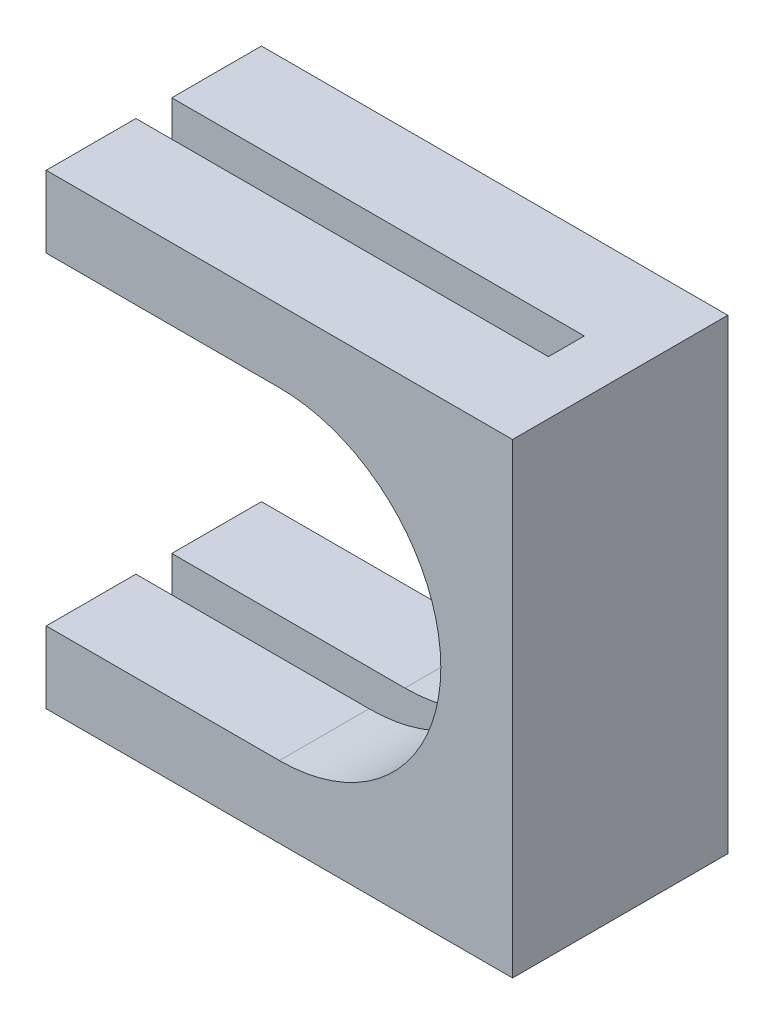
ISO-10303-21;
HEADER;
FILE_DESCRIPTION(('STEP AP214'),'2;1');
FILE_NAME('part.step','',(''),(''),'','','');
FILE_SCHEMA(('AUTOMOTIVE_DESIGN { 1 0 10303 214 1 1 1 1 }'));
ENDSEC;
DATA;
#1=APPLICATION_CONTEXT('core data for automotive mechanical design processes');
#2=APPLICATION_PROTOCOL_DEFINITION('international standard','automotive_design',2000,#1);
#3=PRODUCT_CONTEXT('',#1,'mechanical');
#4=PRODUCT('Part','Part','',(#3));
#5=PRODUCT_RELATED_PRODUCT_CATEGORY('part','',(#4));
#6=PRODUCT_DEFINITION_FORMATION('','',#4);
#7=PRODUCT_DEFINITION_CONTEXT('part definition',#1,'design');
#8=PRODUCT_DEFINITION('design','',#6,#7);
#9=PRODUCT_DEFINITION_SHAPE('','',#8);
#10=(LENGTH_UNIT() NAMED_UNIT(*) SI_UNIT(.MILLI.,.METRE.));
#11=(NAMED_UNIT(*) PLANE_ANGLE_UNIT() SI_UNIT($,.RADIAN.));
#12=(NAMED_UNIT(*) SI_UNIT($,.STERADIAN.) SOLID_ANGLE_UNIT());
#13=UNCERTAINTY_MEASURE_WITH_UNIT(LENGTH_MEASURE(1.E-05),#10,'distance_accuracy_value','');
#14=(GEOMETRIC_REPRESENTATION_CONTEXT(3) GLOBAL_UNCERTAINTY_ASSIGNED_CONTEXT((#13)) GLOBAL_UNIT_ASSIGNED_CONTEXT((#10,
#11,#12)) REPRESENTATION_CONTEXT('',''));
#15=CARTESIAN_POINT('',(0.,0.,0.));
#16=DIRECTION('',(0.,0.,1.));
#17=DIRECTION('',(1.,0.,0.));
#18=AXIS2_PLACEMENT_3D('',#15,#16,#17);
#19=CARTESIAN_POINT('',(3.,0.,0.));
#20=DIRECTION('',(-1.,0.,0.));
#21=DIRECTION('',(0.,0.,1.));
#22=AXIS2_PLACEMENT_3D('',#19,#20,#21);
#23=PLANE('',#22);
#24=DIRECTION('',(0.,1.,0.));
#25=VECTOR('',#24,1.);
#26=CARTESIAN_POINT('',(3.,0.,-28.));
#27=LINE('',#26,#25);
#28=CARTESIAN_POINT('',(3.,-3.,-28.));
#29=VERTEX_POINT('',#28);
#30=CARTESIAN_POINT('',(3.,23.,-28.));
#31=VERTEX_POINT('',#30);
#32=EDGE_CURVE('E189',#29,#31,#27,.T.);
#33=ORIENTED_EDGE('',*,*,#32,.F.);
#34=DIRECTION('',(0.,0.,1.));
#35=VECTOR('',#34,1.);
#36=CARTESIAN_POINT('',(3.,-3.,-40.));
#37=LINE('',#36,#35);
#38=CARTESIAN_POINT('',(3.,-3.,-40.));
#39=VERTEX_POINT('',#38);
#40=EDGE_CURVE('E238',#39,#29,#37,.T.);
#41=ORIENTED_EDGE('',*,*,#40,.F.);
#42=DIRECTION('',(0.,-1.,0.));
#43=VECTOR('',#42,1.);
#44=CARTESIAN_POINT('',(3.,20.,-40.));
#45=LINE('',#44,#43);
#46=CARTESIAN_POINT('',(3.,23.,-40.));
#47=VERTEX_POINT('',#46);
#48=EDGE_CURVE('E248',#47,#39,#45,.T.);
#49=ORIENTED_EDGE('',*,*,#48,.F.);
#50=DIRECTION('',(0.,0.,1.));
#51=VECTOR('',#50,1.);
#52=CARTESIAN_POINT('',(3.,23.,-55.0227155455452));
#53=LINE('',#52,#51);
#54=EDGE_CURVE('E196',#47,#31,#53,.T.);
#55=ORIENTED_EDGE('',*,*,#54,.T.);
#56=EDGE_LOOP('',(#33,#41,#49,#55));
#57=FACE_BOUND('',#56,.T.);
#58=ADVANCED_FACE('F49',(#57),#23,.F.);
#59=CARTESIAN_POINT('',(0.,-3.,0.));
#60=DIRECTION('',(0.,-1.,0.));
#61=DIRECTION('',(0.,0.,-1.));
#62=AXIS2_PLACEMENT_3D('',#59,#60,#61);
#63=PLANE('',#62);
#64=ORIENTED_EDGE('',*,*,#40,.T.);
#65=DIRECTION('',(-1.,0.,0.));
#66=VECTOR('',#65,1.);
#67=CARTESIAN_POINT('',(0.,-3.,-28.));
#68=LINE('',#67,#66);
#69=CARTESIAN_POINT('',(-23.,-3.,-28.));
#70=VERTEX_POINT('',#69);
#71=EDGE_CURVE('E67',#29,#70,#68,.T.);
#72=ORIENTED_EDGE('',*,*,#71,.T.);
#73=DIRECTION('',(0.,0.,-1.));
#74=VECTOR('',#73,1.);
#75=CARTESIAN_POINT('',(-23.,-3.,-28.));
#76=LINE('',#75,#74);
#77=CARTESIAN_POINT('',(-23.,-3.,-33.));
#78=VERTEX_POINT('',#77);
#79=EDGE_CURVE('E214',#70,#78,#76,.T.);
#80=ORIENTED_EDGE('',*,*,#79,.T.);
#81=DIRECTION('',(1.,0.,0.));
#82=VECTOR('',#81,1.);
#83=CARTESIAN_POINT('',(-23.,-3.,-33.));
#84=LINE('',#83,#82);
#85=CARTESIAN_POINT('',(0.,-3.,-33.));
#86=VERTEX_POINT('',#85);
#87=EDGE_CURVE('E218',#78,#86,#84,.T.);
#88=ORIENTED_EDGE('',*,*,#87,.T.);
#89=DIRECTION('',(0.,0.,-1.));
#90=VECTOR('',#89,1.);
#91=CARTESIAN_POINT('',(0.,-3.,-33.));
#92=LINE('',#91,#90);
#93=CARTESIAN_POINT('',(0.,-3.,-35.));
#94=VERTEX_POINT('',#93);
#95=EDGE_CURVE('E222',#86,#94,#92,.T.);
#96=ORIENTED_EDGE('',*,*,#95,.T.);
#97=DIRECTION('',(-1.,0.,0.));
#98=VECTOR('',#97,1.);
#99=CARTESIAN_POINT('',(0.,-3.,-35.));
#100=LINE('',#99,#98);
#101=CARTESIAN_POINT('',(-23.,-3.,-35.));
#102=VERTEX_POINT('',#101);
#103=EDGE_CURVE('E226',#94,#102,#100,.T.);
#104=ORIENTED_EDGE('',*,*,#103,.T.);
#105=DIRECTION('',(0.,0.,-1.));
#106=VECTOR('',#105,1.);
#107=CARTESIAN_POINT('',(-23.,-3.,-35.));
#108=LINE('',#107,#106);
#109=CARTESIAN_POINT('',(-23.,-3.,-40.));
#110=VERTEX_POINT('',#109);
#111=EDGE_CURVE('E230',#102,#110,#108,.T.);
#112=ORIENTED_EDGE('',*,*,#111,.T.);
#113=DIRECTION('',(1.,0.,0.));
#114=VECTOR('',#113,1.);
#115=CARTESIAN_POINT('',(-23.,-3.,-40.));
#116=LINE('',#115,#114);
#117=EDGE_CURVE('E234',#110,#39,#116,.T.);
#118=ORIENTED_EDGE('',*,*,#117,.T.);
#119=EDGE_LOOP('',(#64,#72,#80,#88,#96,#104,#112,#118));
#120=FACE_BOUND('',#119,.T.);
#121=ADVANCED_FACE('F352',(#120),#63,.T.);
#122=CARTESIAN_POINT('',(0.,23.,0.));
#123=DIRECTION('',(0.,-1.,0.));
#124=DIRECTION('',(0.,0.,-1.));
#125=AXIS2_PLACEMENT_3D('',#122,#123,#124);
#126=PLANE('',#125);
#127=DIRECTION('',(-1.,0.,0.));
#128=VECTOR('',#127,1.);
#129=CARTESIAN_POINT('',(0.,23.,-28.));
#130=LINE('',#129,#128);
#131=CARTESIAN_POINT('',(-23.,23.,-28.));
#132=VERTEX_POINT('',#131);
#133=EDGE_CURVE('E75',#31,#132,#130,.T.);
#134=ORIENTED_EDGE('',*,*,#133,.F.);
#135=ORIENTED_EDGE('',*,*,#54,.F.);
#136=DIRECTION('',(1.,0.,0.));
#137=VECTOR('',#136,1.);
#138=CARTESIAN_POINT('',(0.,23.,-40.));
#139=LINE('',#138,#137);
#140=CARTESIAN_POINT('',(-23.,23.,-40.));
#141=VERTEX_POINT('',#140);
#142=EDGE_CURVE('E181',#141,#47,#139,.T.);
#143=ORIENTED_EDGE('',*,*,#142,.F.);
#144=DIRECTION('',(0.,0.,-1.));
#145=VECTOR('',#144,1.);
#146=CARTESIAN_POINT('',(-23.,23.,-55.0227155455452));
#147=LINE('',#146,#145);
#148=CARTESIAN_POINT('',(-23.,23.,-35.));
#149=VERTEX_POINT('',#148);
#150=EDGE_CURVE('E170',#149,#141,#147,.T.);
#151=ORIENTED_EDGE('',*,*,#150,.F.);
#152=DIRECTION('',(-1.,0.,0.));
#153=VECTOR('',#152,1.);
#154=CARTESIAN_POINT('',(0.,23.,-35.));
#155=LINE('',#154,#153);
#156=CARTESIAN_POINT('',(0.,23.,-35.));
#157=VERTEX_POINT('',#156);
#158=EDGE_CURVE('E178',#157,#149,#155,.T.);
#159=ORIENTED_EDGE('',*,*,#158,.F.);
#160=DIRECTION('',(0.,0.,-1.));
#161=VECTOR('',#160,1.);
#162=CARTESIAN_POINT('',(0.,23.,-55.0227155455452));
#163=LINE('',#162,#161);
#164=CARTESIAN_POINT('',(0.,23.,-33.));
#165=VERTEX_POINT('',#164);
#166=EDGE_CURVE('E209',#165,#157,#163,.T.);
#167=ORIENTED_EDGE('',*,*,#166,.F.);
#168=DIRECTION('',(1.,0.,0.));
#169=VECTOR('',#168,1.);
#170=CARTESIAN_POINT('',(0.,23.,-33.));
#171=LINE('',#170,#169);
#172=CARTESIAN_POINT('',(-23.,23.,-33.));
#173=VERTEX_POINT('',#172);
#174=EDGE_CURVE('E205',#173,#165,#171,.T.);
#175=ORIENTED_EDGE('',*,*,#174,.F.);
#176=DIRECTION('',(0.,0.,-1.));
#177=VECTOR('',#176,1.);
#178=CARTESIAN_POINT('',(-23.,23.,-55.0227155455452));
#179=LINE('',#178,#177);
#180=EDGE_CURVE('E201',#132,#173,#179,.T.);
#181=ORIENTED_EDGE('',*,*,#180,.F.);
#182=EDGE_LOOP('',(#134,#135,#143,#151,#159,#167,#175,#181));
#183=FACE_BOUND('',#182,.T.);
#184=ADVANCED_FACE('F176',(#183),#126,.F.);
#185=CARTESIAN_POINT('',(-1.,0.,-35.));
#186=DIRECTION('',(0.,0.,-1.));
#187=DIRECTION('',(0.,-1.,0.));
#188=AXIS2_PLACEMENT_3D('',#185,#186,#187);
#189=PLANE('',#188);
#190=CARTESIAN_POINT('',(-10.,10.,-35.));
#191=DIRECTION('',(0.,0.,-1.));
#192=DIRECTION('',(0.,1.,0.));
#193=AXIS2_PLACEMENT_3D('',#190,#191,#192);
#194=CIRCLE('',#193,9.);
#195=CARTESIAN_POINT('',(-10.,19.,-35.));
#196=VERTEX_POINT('',#195);
#197=CARTESIAN_POINT('',(-10.,1.00000000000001,-35.));
#198=VERTEX_POINT('',#197);
#199=EDGE_CURVE('E245',#196,#198,#194,.T.);
#200=ORIENTED_EDGE('',*,*,#199,.T.);
#201=DIRECTION('',(1.,0.,0.));
#202=VECTOR('',#201,1.);
#203=CARTESIAN_POINT('',(-1.,1.00000000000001,-35.));
#204=LINE('',#203,#202);
#205=CARTESIAN_POINT('',(-23.,1.00000000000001,-35.));
#206=VERTEX_POINT('',#205);
#207=EDGE_CURVE('E249',#206,#198,#204,.T.);
#208=ORIENTED_EDGE('',*,*,#207,.F.);
#209=DIRECTION('',(0.,1.,0.));
#210=VECTOR('',#209,1.);
#211=CARTESIAN_POINT('',(-23.,-1.,-35.));
#212=LINE('',#211,#210);
#213=EDGE_CURVE('E272',#102,#206,#212,.T.);
#214=ORIENTED_EDGE('',*,*,#213,.F.);
#215=ORIENTED_EDGE('',*,*,#103,.F.);
#216=DIRECTION('',(0.,-1.,0.));
#217=VECTOR('',#216,1.);
#218=CARTESIAN_POINT('',(0.,20.,-35.));
#219=LINE('',#218,#217);
#220=EDGE_CURVE('E187',#157,#94,#219,.T.);
#221=ORIENTED_EDGE('',*,*,#220,.F.);
#222=ORIENTED_EDGE('',*,*,#158,.T.);
#223=DIRECTION('',(0.,1.,0.));
#224=VECTOR('',#223,1.);
#225=CARTESIAN_POINT('',(-23.,19.,-35.));
#226=LINE('',#225,#224);
#227=CARTESIAN_POINT('',(-23.,19.,-35.));
#228=VERTEX_POINT('',#227);
#229=EDGE_CURVE('E12',#228,#149,#226,.T.);
#230=ORIENTED_EDGE('',*,*,#229,.F.);
#231=DIRECTION('',(1.,0.,0.));
#232=VECTOR('',#231,1.);
#233=CARTESIAN_POINT('',(-1.,19.,-35.));
#234=LINE('',#233,#232);
#235=EDGE_CURVE('E242',#228,#196,#234,.T.);
#236=ORIENTED_EDGE('',*,*,#235,.T.);
#237=EDGE_LOOP('',(#200,#208,#214,#215,#221,#222,#230,#236));
#238=FACE_BOUND('',#237,.T.);
#239=ADVANCED_FACE('F185',(#238),#189,.F.);
#240=CARTESIAN_POINT('',(-22.,20.,-40.));
#241=DIRECTION('',(0.,0.,1.));
#242=DIRECTION('',(-1.,0.,0.));
#243=AXIS2_PLACEMENT_3D('',#240,#241,#242);
#244=PLANE('',#243);
#245=ORIENTED_EDGE('',*,*,#48,.T.);
#246=ORIENTED_EDGE('',*,*,#117,.F.);
#247=DIRECTION('',(0.,-1.,0.));
#248=VECTOR('',#247,1.);
#249=CARTESIAN_POINT('',(-23.,1.00000000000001,-40.));
#250=LINE('',#249,#248);
#251=CARTESIAN_POINT('',(-23.,1.00000000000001,-40.));
#252=VERTEX_POINT('',#251);
#253=EDGE_CURVE('E300',#252,#110,#250,.T.);
#254=ORIENTED_EDGE('',*,*,#253,.F.);
#255=DIRECTION('',(-1.,0.,0.));
#256=VECTOR('',#255,1.);
#257=CARTESIAN_POINT('',(0.,1.00000000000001,-40.));
#258=LINE('',#257,#256);
#259=CARTESIAN_POINT('',(-10.,1.00000000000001,-40.));
#260=VERTEX_POINT('',#259);
#261=EDGE_CURVE('E252',#260,#252,#258,.T.);
#262=ORIENTED_EDGE('',*,*,#261,.F.);
#263=CARTESIAN_POINT('',(-10.,10.,-40.));
#264=DIRECTION('',(0.,0.,1.));
#265=DIRECTION('',(1.,0.,0.));
#266=AXIS2_PLACEMENT_3D('',#263,#264,#265);
#267=CIRCLE('',#266,9.);
#268=CARTESIAN_POINT('',(-10.,19.,-40.));
#269=VERTEX_POINT('',#268);
#270=EDGE_CURVE('E255',#260,#269,#267,.T.);
#271=ORIENTED_EDGE('',*,*,#270,.T.);
#272=DIRECTION('',(-1.,0.,0.));
#273=VECTOR('',#272,1.);
#274=CARTESIAN_POINT('',(0.,19.,-40.));
#275=LINE('',#274,#273);
#276=CARTESIAN_POINT('',(-23.,19.,-40.));
#277=VERTEX_POINT('',#276);
#278=EDGE_CURVE('E292',#269,#277,#275,.T.);
#279=ORIENTED_EDGE('',*,*,#278,.T.);
#280=DIRECTION('',(0.,-1.,0.));
#281=VECTOR('',#280,1.);
#282=CARTESIAN_POINT('',(-23.,21.,-40.));
#283=LINE('',#282,#281);
#284=EDGE_CURVE('E53',#141,#277,#283,.T.);
#285=ORIENTED_EDGE('',*,*,#284,.F.);
#286=ORIENTED_EDGE('',*,*,#142,.T.);
#287=EDGE_LOOP('',(#245,#246,#254,#262,#271,#279,#285,#286));
#288=FACE_BOUND('',#287,.T.);
#289=ADVANCED_FACE('F334',(#288),#244,.F.);
#290=CARTESIAN_POINT('',(-22.,20.,-28.));
#291=DIRECTION('',(0.,0.,1.));
#292=DIRECTION('',(-1.,0.,0.));
#293=AXIS2_PLACEMENT_3D('',#290,#291,#292);
#294=PLANE('',#293);
#295=DIRECTION('',(-1.,0.,0.));
#296=VECTOR('',#295,1.);
#297=CARTESIAN_POINT('',(0.,19.,-28.));
#298=LINE('',#297,#296);
#299=CARTESIAN_POINT('',(-10.,19.,-28.));
#300=VERTEX_POINT('',#299);
#301=CARTESIAN_POINT('',(-23.,19.,-28.));
#302=VERTEX_POINT('',#301);
#303=EDGE_CURVE('E284',#300,#302,#298,.T.);
#304=ORIENTED_EDGE('',*,*,#303,.F.);
#305=CARTESIAN_POINT('',(-10.,10.,-28.));
#306=DIRECTION('',(0.,0.,1.));
#307=DIRECTION('',(1.,0.,0.));
#308=AXIS2_PLACEMENT_3D('',#305,#306,#307);
#309=CIRCLE('',#308,9.);
#310=CARTESIAN_POINT('',(-10.,1.00000000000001,-28.));
#311=VERTEX_POINT('',#310);
#312=EDGE_CURVE('E273',#311,#300,#309,.T.);
#313=ORIENTED_EDGE('',*,*,#312,.F.);
#314=DIRECTION('',(-1.,0.,0.));
#315=VECTOR('',#314,1.);
#316=CARTESIAN_POINT('',(0.,1.00000000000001,-28.));
#317=LINE('',#316,#315);
#318=CARTESIAN_POINT('',(-23.,1.00000000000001,-28.));
#319=VERTEX_POINT('',#318);
#320=EDGE_CURVE('E268',#311,#319,#317,.T.);
#321=ORIENTED_EDGE('',*,*,#320,.T.);
#322=DIRECTION('',(0.,1.,0.));
#323=VECTOR('',#322,1.);
#324=CARTESIAN_POINT('',(-23.,-1.,-28.));
#325=LINE('',#324,#323);
#326=EDGE_CURVE('E303',#70,#319,#325,.T.);
#327=ORIENTED_EDGE('',*,*,#326,.F.);
#328=ORIENTED_EDGE('',*,*,#71,.F.);
#329=ORIENTED_EDGE('',*,*,#32,.T.);
#330=ORIENTED_EDGE('',*,*,#133,.T.);
#331=DIRECTION('',(0.,1.,0.));
#332=VECTOR('',#331,1.);
#333=CARTESIAN_POINT('',(-23.,19.,-28.));
#334=LINE('',#333,#332);
#335=EDGE_CURVE('E322',#302,#132,#334,.T.);
#336=ORIENTED_EDGE('',*,*,#335,.F.);
#337=EDGE_LOOP('',(#304,#313,#321,#327,#328,#329,#330,#336));
#338=FACE_BOUND('',#337,.T.);
#339=ADVANCED_FACE('F373',(#338),#294,.T.);
#340=CARTESIAN_POINT('',(-1.,0.,-33.));
#341=DIRECTION('',(0.,0.,1.));
#342=DIRECTION('',(0.,1.,0.));
#343=AXIS2_PLACEMENT_3D('',#340,#341,#342);
#344=PLANE('',#343);
#345=CARTESIAN_POINT('',(-10.,10.,-33.));
#346=DIRECTION('',(0.,0.,1.));
#347=DIRECTION('',(0.,-1.,0.));
#348=AXIS2_PLACEMENT_3D('',#345,#346,#347);
#349=CIRCLE('',#348,9.);
#350=CARTESIAN_POINT('',(-10.,1.00000000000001,-33.));
#351=VERTEX_POINT('',#350);
#352=CARTESIAN_POINT('',(-10.,19.,-33.));
#353=VERTEX_POINT('',#352);
#354=EDGE_CURVE('E264',#351,#353,#349,.T.);
#355=ORIENTED_EDGE('',*,*,#354,.T.);
#356=DIRECTION('',(-1.,0.,0.));
#357=VECTOR('',#356,1.);
#358=CARTESIAN_POINT('',(-1.,19.,-33.));
#359=LINE('',#358,#357);
#360=CARTESIAN_POINT('',(-23.,19.,-33.));
#361=VERTEX_POINT('',#360);
#362=EDGE_CURVE('E261',#353,#361,#359,.T.);
#363=ORIENTED_EDGE('',*,*,#362,.T.);
#364=DIRECTION('',(0.,-1.,0.));
#365=VECTOR('',#364,1.);
#366=CARTESIAN_POINT('',(-23.,21.,-33.));
#367=LINE('',#366,#365);
#368=EDGE_CURVE('E314',#173,#361,#367,.T.);
#369=ORIENTED_EDGE('',*,*,#368,.F.);
#370=ORIENTED_EDGE('',*,*,#174,.T.);
#371=DIRECTION('',(0.,-1.,0.));
#372=VECTOR('',#371,1.);
#373=CARTESIAN_POINT('',(0.,20.,-33.));
#374=LINE('',#373,#372);
#375=EDGE_CURVE('E258',#165,#86,#374,.T.);
#376=ORIENTED_EDGE('',*,*,#375,.T.);
#377=ORIENTED_EDGE('',*,*,#87,.F.);
#378=DIRECTION('',(0.,-1.,0.));
#379=VECTOR('',#378,1.);
#380=CARTESIAN_POINT('',(-23.,1.00000000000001,-33.));
#381=LINE('',#380,#379);
#382=CARTESIAN_POINT('',(-23.,1.00000000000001,-33.));
#383=VERTEX_POINT('',#382);
#384=EDGE_CURVE('E311',#383,#78,#381,.T.);
#385=ORIENTED_EDGE('',*,*,#384,.F.);
#386=DIRECTION('',(-1.,0.,0.));
#387=VECTOR('',#386,1.);
#388=CARTESIAN_POINT('',(-1.,1.00000000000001,-33.));
#389=LINE('',#388,#387);
#390=EDGE_CURVE('E269',#351,#383,#389,.T.);
#391=ORIENTED_EDGE('',*,*,#390,.F.);
#392=EDGE_LOOP('',(#355,#363,#369,#370,#376,#377,#385,#391));
#393=FACE_BOUND('',#392,.T.);
#394=ADVANCED_FACE('F363',(#393),#344,.F.);
#395=CARTESIAN_POINT('',(0.,20.,0.));
#396=DIRECTION('',(-1.,0.,0.));
#397=DIRECTION('',(0.,0.,1.));
#398=AXIS2_PLACEMENT_3D('',#395,#396,#397);
#399=PLANE('',#398);
#400=ORIENTED_EDGE('',*,*,#220,.T.);
#401=ORIENTED_EDGE('',*,*,#95,.F.);
#402=ORIENTED_EDGE('',*,*,#375,.F.);
#403=ORIENTED_EDGE('',*,*,#166,.T.);
#404=EDGE_LOOP('',(#400,#401,#402,#403));
#405=FACE_BOUND('',#404,.T.);
#406=ADVANCED_FACE('F366',(#405),#399,.T.);
#407=CARTESIAN_POINT('',(0.,1.00000000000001,-40.));
#408=DIRECTION('',(0.,1.,0.));
#409=DIRECTION('',(-1.,0.,0.));
#410=AXIS2_PLACEMENT_3D('',#407,#408,#409);
#411=PLANE('',#410);
#412=ORIENTED_EDGE('',*,*,#207,.T.);
#413=DIRECTION('',(0.,0.,1.));
#414=VECTOR('',#413,1.);
#415=CARTESIAN_POINT('',(-10.,1.00000000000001,-40.));
#416=LINE('',#415,#414);
#417=EDGE_CURVE('E274',#260,#198,#416,.T.);
#418=ORIENTED_EDGE('',*,*,#417,.F.);
#419=ORIENTED_EDGE('',*,*,#261,.T.);
#420=DIRECTION('',(0.,0.,-1.));
#421=VECTOR('',#420,1.);
#422=CARTESIAN_POINT('',(-23.,1.00000000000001,-35.));
#423=LINE('',#422,#421);
#424=EDGE_CURVE('E304',#206,#252,#423,.T.);
#425=ORIENTED_EDGE('',*,*,#424,.F.);
#426=EDGE_LOOP('',(#412,#418,#419,#425));
#427=FACE_BOUND('',#426,.T.);
#428=ADVANCED_FACE('F344',(#427),#411,.T.);
#429=CARTESIAN_POINT('',(-10.,10.,-40.));
#430=DIRECTION('',(0.,0.,1.));
#431=DIRECTION('',(1.,0.,0.));
#432=AXIS2_PLACEMENT_3D('',#429,#430,#431);
#433=CYLINDRICAL_SURFACE('',#432,9.);
#434=DIRECTION('',(0.,0.,1.));
#435=VECTOR('',#434,1.);
#436=CARTESIAN_POINT('',(-10.,19.,-40.));
#437=LINE('',#436,#435);
#438=EDGE_CURVE('E278',#269,#196,#437,.T.);
#439=ORIENTED_EDGE('',*,*,#438,.F.);
#440=ORIENTED_EDGE('',*,*,#270,.F.);
#441=ORIENTED_EDGE('',*,*,#417,.T.);
#442=ORIENTED_EDGE('',*,*,#199,.F.);
#443=EDGE_LOOP('',(#439,#440,#441,#442));
#444=FACE_BOUND('',#443,.T.);
#445=ADVANCED_FACE('F342',(#444),#433,.F.);
#446=CARTESIAN_POINT('',(0.,19.,-40.));
#447=DIRECTION('',(0.,1.,0.));
#448=DIRECTION('',(0.,0.,1.));
#449=AXIS2_PLACEMENT_3D('',#446,#447,#448);
#450=PLANE('',#449);
#451=ORIENTED_EDGE('',*,*,#235,.F.);
#452=DIRECTION('',(0.,0.,1.));
#453=VECTOR('',#452,1.);
#454=CARTESIAN_POINT('',(-23.,19.,-40.));
#455=LINE('',#454,#453);
#456=EDGE_CURVE('E59',#277,#228,#455,.T.);
#457=ORIENTED_EDGE('',*,*,#456,.F.);
#458=ORIENTED_EDGE('',*,*,#278,.F.);
#459=ORIENTED_EDGE('',*,*,#438,.T.);
#460=EDGE_LOOP('',(#451,#457,#458,#459));
#461=FACE_BOUND('',#460,.T.);
#462=ADVANCED_FACE('F339',(#461),#450,.F.);
#463=EDGE_CURVE('E283',#353,#300,#437,.T.);
#464=ORIENTED_EDGE('',*,*,#463,.T.);
#465=ORIENTED_EDGE('',*,*,#303,.T.);
#466=DIRECTION('',(0.,0.,1.));
#467=VECTOR('',#466,1.);
#468=CARTESIAN_POINT('',(-23.,19.,-33.));
#469=LINE('',#468,#467);
#470=EDGE_CURVE('E325',#361,#302,#469,.T.);
#471=ORIENTED_EDGE('',*,*,#470,.F.);
#472=ORIENTED_EDGE('',*,*,#362,.F.);
#473=EDGE_LOOP('',(#464,#465,#471,#472));
#474=FACE_BOUND('',#473,.T.);
#475=ADVANCED_FACE('F376',(#474),#450,.F.);
#476=EDGE_CURVE('E279',#351,#311,#416,.T.);
#477=ORIENTED_EDGE('',*,*,#476,.T.);
#478=ORIENTED_EDGE('',*,*,#312,.T.);
#479=ORIENTED_EDGE('',*,*,#463,.F.);
#480=ORIENTED_EDGE('',*,*,#354,.F.);
#481=EDGE_LOOP('',(#477,#478,#479,#480));
#482=FACE_BOUND('',#481,.T.);
#483=ADVANCED_FACE('F381',(#482),#433,.F.);
#484=ORIENTED_EDGE('',*,*,#390,.T.);
#485=DIRECTION('',(0.,0.,-1.));
#486=VECTOR('',#485,1.);
#487=CARTESIAN_POINT('',(-23.,1.00000000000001,-28.));
#488=LINE('',#487,#486);
#489=EDGE_CURVE('E315',#319,#383,#488,.T.);
#490=ORIENTED_EDGE('',*,*,#489,.F.);
#491=ORIENTED_EDGE('',*,*,#320,.F.);
#492=ORIENTED_EDGE('',*,*,#476,.F.);
#493=EDGE_LOOP('',(#484,#490,#491,#492));
#494=FACE_BOUND('',#493,.T.);
#495=ADVANCED_FACE('F385',(#494),#411,.T.);
#496=CARTESIAN_POINT('',(-23.,0.,0.));
#497=DIRECTION('',(-1.,0.,0.));
#498=DIRECTION('',(0.,0.,1.));
#499=AXIS2_PLACEMENT_3D('',#496,#497,#498);
#500=PLANE('',#499);
#501=ORIENTED_EDGE('',*,*,#253,.T.);
#502=ORIENTED_EDGE('',*,*,#111,.F.);
#503=ORIENTED_EDGE('',*,*,#213,.T.);
#504=ORIENTED_EDGE('',*,*,#424,.T.);
#505=EDGE_LOOP('',(#501,#502,#503,#504));
#506=FACE_BOUND('',#505,.T.);
#507=ADVANCED_FACE('F348',(#506),#500,.T.);
#508=CARTESIAN_POINT('',(-23.,0.,0.));
#509=DIRECTION('',(-1.,0.,0.));
#510=DIRECTION('',(0.,0.,1.));
#511=AXIS2_PLACEMENT_3D('',#508,#509,#510);
#512=PLANE('',#511);
#513=ORIENTED_EDGE('',*,*,#384,.T.);
#514=ORIENTED_EDGE('',*,*,#79,.F.);
#515=ORIENTED_EDGE('',*,*,#326,.T.);
#516=ORIENTED_EDGE('',*,*,#489,.T.);
#517=EDGE_LOOP('',(#513,#514,#515,#516));
#518=FACE_BOUND('',#517,.T.);
#519=ADVANCED_FACE('F358',(#518),#512,.T.);
#520=CARTESIAN_POINT('',(-23.,0.,0.));
#521=DIRECTION('',(-1.,0.,0.));
#522=DIRECTION('',(0.,0.,1.));
#523=AXIS2_PLACEMENT_3D('',#520,#521,#522);
#524=PLANE('',#523);
#525=ORIENTED_EDGE('',*,*,#368,.T.);
#526=ORIENTED_EDGE('',*,*,#470,.T.);
#527=ORIENTED_EDGE('',*,*,#335,.T.);
#528=ORIENTED_EDGE('',*,*,#180,.T.);
#529=EDGE_LOOP('',(#525,#526,#527,#528));
#530=FACE_BOUND('',#529,.T.);
#531=ADVANCED_FACE('F369',(#530),#524,.T.);
#532=CARTESIAN_POINT('',(-23.,0.,0.));
#533=DIRECTION('',(-1.,0.,0.));
#534=DIRECTION('',(0.,0.,1.));
#535=AXIS2_PLACEMENT_3D('',#532,#533,#534);
#536=PLANE('',#535);
#537=ORIENTED_EDGE('',*,*,#284,.T.);
#538=ORIENTED_EDGE('',*,*,#456,.T.);
#539=ORIENTED_EDGE('',*,*,#229,.T.);
#540=ORIENTED_EDGE('',*,*,#150,.T.);
#541=EDGE_LOOP('',(#537,#538,#539,#540));
#542=FACE_BOUND('',#541,.T.);
#543=ADVANCED_FACE('F51',(#542),#536,.T.);
#544=CLOSED_SHELL('',(#58,#121,#184,#239,#289,#339,#394,#406,#428,#445,#462,#475,#483,#495,#507,
#519,#531,#543));
#545=MANIFOLD_SOLID_BREP('B2',#544);
#546=ADVANCED_BREP_SHAPE_REPRESENTATION('',(#18,#545),#14);
#547=SHAPE_DEFINITION_REPRESENTATION(#9,#546);
ENDSEC;
END-ISO-10303-21;
